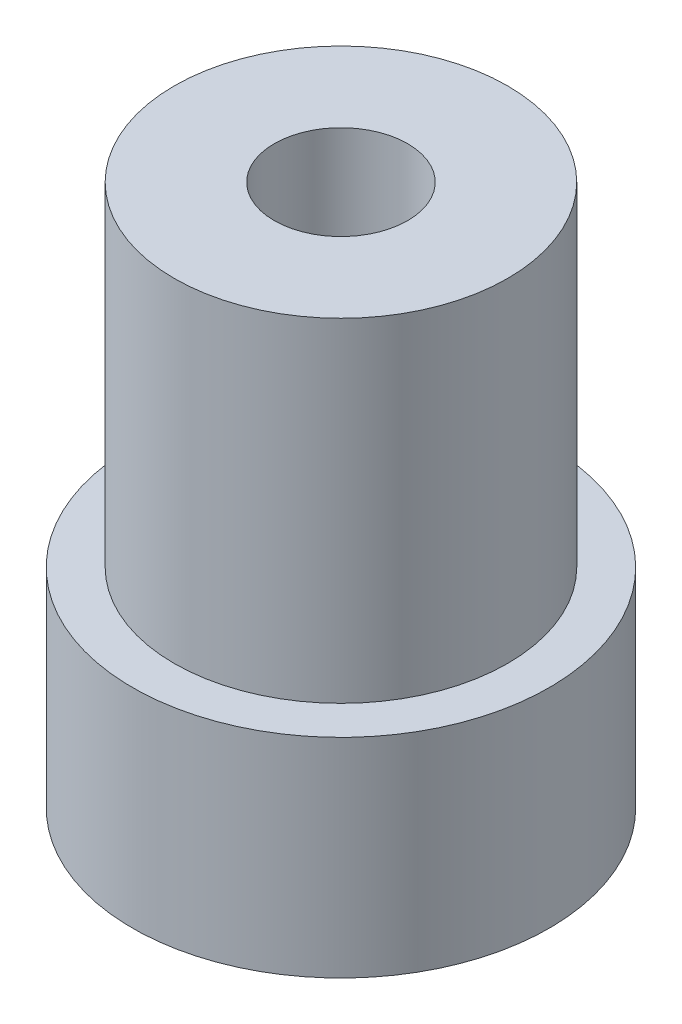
ISO-10303-21;
HEADER;
FILE_DESCRIPTION(('STEP AP214'),'2;1');
FILE_NAME('part.step','',(''),(''),'','','');
FILE_SCHEMA(('AUTOMOTIVE_DESIGN { 1 0 10303 214 1 1 1 1 }'));
ENDSEC;
DATA;
#1=APPLICATION_CONTEXT('core data for automotive mechanical design processes');
#2=APPLICATION_PROTOCOL_DEFINITION('international standard','automotive_design',2000,#1);
#3=PRODUCT_CONTEXT('',#1,'mechanical');
#4=PRODUCT('Part','Part','',(#3));
#5=PRODUCT_RELATED_PRODUCT_CATEGORY('part','',(#4));
#6=PRODUCT_DEFINITION_FORMATION('','',#4);
#7=PRODUCT_DEFINITION_CONTEXT('part definition',#1,'design');
#8=PRODUCT_DEFINITION('design','',#6,#7);
#9=PRODUCT_DEFINITION_SHAPE('','',#8);
#10=(LENGTH_UNIT() NAMED_UNIT(*) SI_UNIT(.MILLI.,.METRE.));
#11=(NAMED_UNIT(*) PLANE_ANGLE_UNIT() SI_UNIT($,.RADIAN.));
#12=(NAMED_UNIT(*) SI_UNIT($,.STERADIAN.) SOLID_ANGLE_UNIT());
#13=UNCERTAINTY_MEASURE_WITH_UNIT(LENGTH_MEASURE(1.E-05),#10,'distance_accuracy_value','');
#14=(GEOMETRIC_REPRESENTATION_CONTEXT(3) GLOBAL_UNCERTAINTY_ASSIGNED_CONTEXT((#13)) GLOBAL_UNIT_ASSIGNED_CONTEXT((#10,
#11,#12)) REPRESENTATION_CONTEXT('',''));
#15=CARTESIAN_POINT('',(0.,0.,0.));
#16=DIRECTION('',(0.,0.,1.));
#17=DIRECTION('',(1.,0.,0.));
#18=AXIS2_PLACEMENT_3D('',#15,#16,#17);
#19=CARTESIAN_POINT('',(0.,8.,0.));
#20=DIRECTION('',(0.,1.,0.));
#21=DIRECTION('',(0.,0.,1.));
#22=AXIS2_PLACEMENT_3D('',#19,#20,#21);
#23=PLANE('',#22);
#24=CARTESIAN_POINT('',(0.,8.,0.));
#25=DIRECTION('',(0.,1.,0.));
#26=DIRECTION('',(0.,0.,1.));
#27=AXIS2_PLACEMENT_3D('',#24,#25,#26);
#28=CIRCLE('',#27,4.);
#29=CARTESIAN_POINT('',(0.,8.,4.));
#30=VERTEX_POINT('',#29);
#31=EDGE_CURVE('E12',#30,#30,#28,.T.);
#32=ORIENTED_EDGE('',*,*,#31,.T.);
#33=EDGE_LOOP('',(#32));
#34=FACE_BOUND('',#33,.T.);
#35=CARTESIAN_POINT('',(0.,8.,0.));
#36=DIRECTION('',(0.,1.,0.));
#37=DIRECTION('',(0.,0.,1.));
#38=AXIS2_PLACEMENT_3D('',#35,#36,#37);
#39=CIRCLE('',#38,1.6);
#40=CARTESIAN_POINT('',(0.,8.,1.6));
#41=VERTEX_POINT('',#40);
#42=EDGE_CURVE('E49',#41,#41,#39,.T.);
#43=ORIENTED_EDGE('',*,*,#42,.F.);
#44=EDGE_LOOP('',(#43));
#45=FACE_BOUND('',#44,.T.);
#46=ADVANCED_FACE('F41',(#34,#45),#23,.T.);
#47=CARTESIAN_POINT('',(0.,8.,0.));
#48=DIRECTION('',(0.,-1.,0.));
#49=DIRECTION('',(0.,0.,-1.));
#50=AXIS2_PLACEMENT_3D('',#47,#48,#49);
#51=CYLINDRICAL_SURFACE('',#50,4.);
#52=ORIENTED_EDGE('',*,*,#31,.F.);
#53=EDGE_LOOP('',(#52));
#54=FACE_BOUND('',#53,.T.);
#55=CARTESIAN_POINT('',(0.,0.,0.));
#56=DIRECTION('',(0.,-1.,0.));
#57=DIRECTION('',(0.,0.,-1.));
#58=AXIS2_PLACEMENT_3D('',#55,#56,#57);
#59=CIRCLE('',#58,4.);
#60=CARTESIAN_POINT('',(0.,0.,-4.));
#61=VERTEX_POINT('',#60);
#62=EDGE_CURVE('E140',#61,#61,#59,.T.);
#63=ORIENTED_EDGE('',*,*,#62,.F.);
#64=EDGE_LOOP('',(#63));
#65=FACE_BOUND('',#64,.T.);
#66=ADVANCED_FACE('F43',(#54,#65),#51,.T.);
#67=CARTESIAN_POINT('',(0.,8.,0.));
#68=DIRECTION('',(0.,-1.,0.));
#69=DIRECTION('',(0.,0.,-1.));
#70=AXIS2_PLACEMENT_3D('',#67,#68,#69);
#71=CYLINDRICAL_SURFACE('',#70,1.6);
#72=ORIENTED_EDGE('',*,*,#42,.T.);
#73=EDGE_LOOP('',(#72));
#74=FACE_BOUND('',#73,.T.);
#75=CARTESIAN_POINT('',(0.,-2.,0.));
#76=DIRECTION('',(0.,-1.,0.));
#77=DIRECTION('',(0.,0.,-1.));
#78=AXIS2_PLACEMENT_3D('',#75,#76,#77);
#79=CIRCLE('',#78,1.6);
#80=CARTESIAN_POINT('',(0.,-2.,-1.6));
#81=VERTEX_POINT('',#80);
#82=EDGE_CURVE('E145',#81,#81,#79,.T.);
#83=ORIENTED_EDGE('',*,*,#82,.T.);
#84=EDGE_LOOP('',(#83));
#85=FACE_BOUND('',#84,.T.);
#86=ADVANCED_FACE('F163',(#74,#85),#71,.F.);
#87=CARTESIAN_POINT('',(0.,-2.,0.));
#88=DIRECTION('',(0.,-1.,0.));
#89=DIRECTION('',(0.,0.,-1.));
#90=AXIS2_PLACEMENT_3D('',#87,#88,#89);
#91=PLANE('',#90);
#92=DIRECTION('',(0.499999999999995,0.,0.866025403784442));
#93=VECTOR('',#92,1.);
#94=CARTESIAN_POINT('',(1.65988202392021,-2.,-2.87499999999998));
#95=LINE('',#94,#93);
#96=CARTESIAN_POINT('',(1.65988202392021,-2.,-2.87499999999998));
#97=VERTEX_POINT('',#96);
#98=CARTESIAN_POINT('',(3.31976404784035,-2.,0.));
#99=VERTEX_POINT('',#98);
#100=EDGE_CURVE('E148',#97,#99,#95,.T.);
#101=ORIENTED_EDGE('',*,*,#100,.T.);
#102=DIRECTION('',(-0.500000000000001,0.,0.866025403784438));
#103=VECTOR('',#102,1.);
#104=CARTESIAN_POINT('',(3.31976404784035,-2.,0.));
#105=LINE('',#104,#103);
#106=CARTESIAN_POINT('',(1.65988202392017,-2.,2.875));
#107=VERTEX_POINT('',#106);
#108=EDGE_CURVE('E109',#99,#107,#105,.T.);
#109=ORIENTED_EDGE('',*,*,#108,.T.);
#110=DIRECTION('',(-1.,0.,0.));
#111=VECTOR('',#110,1.);
#112=CARTESIAN_POINT('',(1.65988202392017,-2.,2.875));
#113=LINE('',#112,#111);
#114=CARTESIAN_POINT('',(-1.65988202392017,-2.,2.875));
#115=VERTEX_POINT('',#114);
#116=EDGE_CURVE('E64',#107,#115,#113,.T.);
#117=ORIENTED_EDGE('',*,*,#116,.T.);
#118=DIRECTION('',(-0.499999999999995,0.,-0.866025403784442));
#119=VECTOR('',#118,1.);
#120=CARTESIAN_POINT('',(-1.65988202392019,-2.,2.87499999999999));
#121=LINE('',#120,#119);
#122=CARTESIAN_POINT('',(-3.31976404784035,-2.,0.));
#123=VERTEX_POINT('',#122);
#124=EDGE_CURVE('E152',#115,#123,#121,.T.);
#125=ORIENTED_EDGE('',*,*,#124,.T.);
#126=DIRECTION('',(0.500000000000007,0.,-0.866025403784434));
#127=VECTOR('',#126,1.);
#128=CARTESIAN_POINT('',(-3.31976404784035,-2.,0.));
#129=LINE('',#128,#127);
#130=CARTESIAN_POINT('',(-1.65988202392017,-2.,-2.875));
#131=VERTEX_POINT('',#130);
#132=EDGE_CURVE('E155',#123,#131,#129,.T.);
#133=ORIENTED_EDGE('',*,*,#132,.T.);
#134=DIRECTION('',(1.,0.,0.));
#135=VECTOR('',#134,1.);
#136=CARTESIAN_POINT('',(-1.65988202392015,-2.,-2.87500000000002));
#137=LINE('',#136,#135);
#138=EDGE_CURVE('E158',#131,#97,#137,.T.);
#139=ORIENTED_EDGE('',*,*,#138,.T.);
#140=EDGE_LOOP('',(#101,#109,#117,#125,#133,#139));
#141=FACE_BOUND('',#140,.T.);
#142=ORIENTED_EDGE('',*,*,#82,.F.);
#143=EDGE_LOOP('',(#142));
#144=FACE_BOUND('',#143,.T.);
#145=ADVANCED_FACE('F175',(#141,#144),#91,.T.);
#146=CARTESIAN_POINT('',(0.,0.,0.));
#147=DIRECTION('',(0.,-1.,0.));
#148=DIRECTION('',(0.,0.,-1.));
#149=AXIS2_PLACEMENT_3D('',#146,#147,#148);
#150=PLANE('',#149);
#151=CARTESIAN_POINT('',(0.,0.,0.));
#152=DIRECTION('',(0.,-1.,0.));
#153=DIRECTION('',(0.,0.,-1.));
#154=AXIS2_PLACEMENT_3D('',#151,#152,#153);
#155=CIRCLE('',#154,5.);
#156=CARTESIAN_POINT('',(0.,0.,-5.));
#157=VERTEX_POINT('',#156);
#158=EDGE_CURVE('E110',#157,#157,#155,.T.);
#159=ORIENTED_EDGE('',*,*,#158,.F.);
#160=EDGE_LOOP('',(#159));
#161=FACE_BOUND('',#160,.T.);
#162=ORIENTED_EDGE('',*,*,#62,.T.);
#163=EDGE_LOOP('',(#162));
#164=FACE_BOUND('',#163,.T.);
#165=ADVANCED_FACE('F178',(#161,#164),#150,.F.);
#166=CARTESIAN_POINT('',(0.,-5.,0.));
#167=DIRECTION('',(0.,-1.,0.));
#168=DIRECTION('',(0.,0.,-1.));
#169=AXIS2_PLACEMENT_3D('',#166,#167,#168);
#170=PLANE('',#169);
#171=CARTESIAN_POINT('',(0.,-5.,0.));
#172=DIRECTION('',(0.,-1.,0.));
#173=DIRECTION('',(0.,0.,-1.));
#174=AXIS2_PLACEMENT_3D('',#171,#172,#173);
#175=CIRCLE('',#174,5.);
#176=CARTESIAN_POINT('',(0.,-5.,-5.));
#177=VERTEX_POINT('',#176);
#178=EDGE_CURVE('E137',#177,#177,#175,.T.);
#179=ORIENTED_EDGE('',*,*,#178,.T.);
#180=EDGE_LOOP('',(#179));
#181=FACE_BOUND('',#180,.T.);
#182=DIRECTION('',(-0.5,0.,0.866025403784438));
#183=VECTOR('',#182,1.);
#184=CARTESIAN_POINT('',(3.31976404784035,-5.,0.));
#185=LINE('',#184,#183);
#186=CARTESIAN_POINT('',(3.31976404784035,-5.,0.));
#187=VERTEX_POINT('',#186);
#188=CARTESIAN_POINT('',(1.65988202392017,-5.,2.875));
#189=VERTEX_POINT('',#188);
#190=EDGE_CURVE('E104',#187,#189,#185,.T.);
#191=ORIENTED_EDGE('',*,*,#190,.F.);
#192=DIRECTION('',(0.5,0.,0.866025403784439));
#193=VECTOR('',#192,1.);
#194=CARTESIAN_POINT('',(1.65988202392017,-5.,-2.875));
#195=LINE('',#194,#193);
#196=CARTESIAN_POINT('',(1.65988202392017,-5.,-2.875));
#197=VERTEX_POINT('',#196);
#198=EDGE_CURVE('E96',#197,#187,#195,.T.);
#199=ORIENTED_EDGE('',*,*,#198,.F.);
#200=DIRECTION('',(1.,0.,0.));
#201=VECTOR('',#200,1.);
#202=CARTESIAN_POINT('',(-1.65988202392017,-5.,-2.875));
#203=LINE('',#202,#201);
#204=CARTESIAN_POINT('',(-1.65988202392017,-5.,-2.875));
#205=VERTEX_POINT('',#204);
#206=EDGE_CURVE('E125',#205,#197,#203,.T.);
#207=ORIENTED_EDGE('',*,*,#206,.F.);
#208=DIRECTION('',(0.5,0.,-0.866025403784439));
#209=VECTOR('',#208,1.);
#210=CARTESIAN_POINT('',(-3.31976404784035,-5.,0.));
#211=LINE('',#210,#209);
#212=CARTESIAN_POINT('',(-3.31976404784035,-5.,0.));
#213=VERTEX_POINT('',#212);
#214=EDGE_CURVE('E122',#213,#205,#211,.T.);
#215=ORIENTED_EDGE('',*,*,#214,.F.);
#216=DIRECTION('',(-0.5,0.,-0.866025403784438));
#217=VECTOR('',#216,1.);
#218=CARTESIAN_POINT('',(-1.65988202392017,-5.,2.875));
#219=LINE('',#218,#217);
#220=CARTESIAN_POINT('',(-1.65988202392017,-5.,2.875));
#221=VERTEX_POINT('',#220);
#222=EDGE_CURVE('E118',#221,#213,#219,.T.);
#223=ORIENTED_EDGE('',*,*,#222,.F.);
#224=DIRECTION('',(-1.,0.,0.));
#225=VECTOR('',#224,1.);
#226=CARTESIAN_POINT('',(1.65988202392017,-5.,2.875));
#227=LINE('',#226,#225);
#228=EDGE_CURVE('E116',#189,#221,#227,.T.);
#229=ORIENTED_EDGE('',*,*,#228,.F.);
#230=EDGE_LOOP('',(#191,#199,#207,#215,#223,#229));
#231=FACE_BOUND('',#230,.T.);
#232=ADVANCED_FACE('F114',(#181,#231),#170,.T.);
#233=CARTESIAN_POINT('',(0.,-5.,0.));
#234=DIRECTION('',(0.,1.,0.));
#235=DIRECTION('',(0.,0.,1.));
#236=AXIS2_PLACEMENT_3D('',#233,#234,#235);
#237=CYLINDRICAL_SURFACE('',#236,5.);
#238=ORIENTED_EDGE('',*,*,#178,.F.);
#239=EDGE_LOOP('',(#238));
#240=FACE_BOUND('',#239,.T.);
#241=ORIENTED_EDGE('',*,*,#158,.T.);
#242=EDGE_LOOP('',(#241));
#243=FACE_BOUND('',#242,.T.);
#244=ADVANCED_FACE('F180',(#240,#243),#237,.T.);
#245=CARTESIAN_POINT('',(1.65988202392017,-5.,-2.875));
#246=DIRECTION('',(-0.866025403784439,0.,0.5));
#247=DIRECTION('',(0.5,0.,0.866025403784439));
#248=AXIS2_PLACEMENT_3D('',#245,#246,#247);
#249=PLANE('',#248);
#250=DIRECTION('',(0.,1.,0.));
#251=VECTOR('',#250,1.);
#252=CARTESIAN_POINT('',(3.31976404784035,-5.,0.));
#253=LINE('',#252,#251);
#254=EDGE_CURVE('E99',#187,#99,#253,.T.);
#255=ORIENTED_EDGE('',*,*,#254,.T.);
#256=ORIENTED_EDGE('',*,*,#100,.F.);
#257=DIRECTION('',(0.,1.,0.));
#258=VECTOR('',#257,1.);
#259=CARTESIAN_POINT('',(1.65988202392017,-5.,-2.875));
#260=LINE('',#259,#258);
#261=EDGE_CURVE('E56',#197,#97,#260,.T.);
#262=ORIENTED_EDGE('',*,*,#261,.F.);
#263=ORIENTED_EDGE('',*,*,#198,.T.);
#264=EDGE_LOOP('',(#255,#256,#262,#263));
#265=FACE_BOUND('',#264,.T.);
#266=ADVANCED_FACE('F98',(#265),#249,.T.);
#267=CARTESIAN_POINT('',(3.31976404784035,-5.,0.));
#268=DIRECTION('',(-0.866025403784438,0.,-0.5));
#269=DIRECTION('',(-0.5,0.,0.866025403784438));
#270=AXIS2_PLACEMENT_3D('',#267,#268,#269);
#271=PLANE('',#270);
#272=DIRECTION('',(0.,1.,0.));
#273=VECTOR('',#272,1.);
#274=CARTESIAN_POINT('',(1.65988202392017,-5.,2.875));
#275=LINE('',#274,#273);
#276=EDGE_CURVE('E111',#189,#107,#275,.T.);
#277=ORIENTED_EDGE('',*,*,#276,.T.);
#278=ORIENTED_EDGE('',*,*,#108,.F.);
#279=ORIENTED_EDGE('',*,*,#254,.F.);
#280=ORIENTED_EDGE('',*,*,#190,.T.);
#281=EDGE_LOOP('',(#277,#278,#279,#280));
#282=FACE_BOUND('',#281,.T.);
#283=ADVANCED_FACE('F107',(#282),#271,.T.);
#284=CARTESIAN_POINT('',(1.65988202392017,-5.,2.875));
#285=DIRECTION('',(0.,0.,-1.));
#286=DIRECTION('',(-1.,0.,0.));
#287=AXIS2_PLACEMENT_3D('',#284,#285,#286);
#288=PLANE('',#287);
#289=DIRECTION('',(0.,1.,0.));
#290=VECTOR('',#289,1.);
#291=CARTESIAN_POINT('',(-1.65988202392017,-5.,2.875));
#292=LINE('',#291,#290);
#293=EDGE_CURVE('E134',#221,#115,#292,.T.);
#294=ORIENTED_EDGE('',*,*,#293,.T.);
#295=ORIENTED_EDGE('',*,*,#116,.F.);
#296=ORIENTED_EDGE('',*,*,#276,.F.);
#297=ORIENTED_EDGE('',*,*,#228,.T.);
#298=EDGE_LOOP('',(#294,#295,#296,#297));
#299=FACE_BOUND('',#298,.T.);
#300=ADVANCED_FACE('F194',(#299),#288,.T.);
#301=CARTESIAN_POINT('',(-1.65988202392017,-5.,2.875));
#302=DIRECTION('',(0.866025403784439,0.,-0.5));
#303=DIRECTION('',(-0.5,0.,-0.866025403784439));
#304=AXIS2_PLACEMENT_3D('',#301,#302,#303);
#305=PLANE('',#304);
#306=DIRECTION('',(0.,1.,0.));
#307=VECTOR('',#306,1.);
#308=CARTESIAN_POINT('',(-3.31976404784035,-5.,0.));
#309=LINE('',#308,#307);
#310=EDGE_CURVE('E131',#213,#123,#309,.T.);
#311=ORIENTED_EDGE('',*,*,#310,.T.);
#312=ORIENTED_EDGE('',*,*,#124,.F.);
#313=ORIENTED_EDGE('',*,*,#293,.F.);
#314=ORIENTED_EDGE('',*,*,#222,.T.);
#315=EDGE_LOOP('',(#311,#312,#313,#314));
#316=FACE_BOUND('',#315,.T.);
#317=ADVANCED_FACE('F197',(#316),#305,.T.);
#318=CARTESIAN_POINT('',(-3.31976404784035,-5.,0.));
#319=DIRECTION('',(0.866025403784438,0.,0.5));
#320=DIRECTION('',(0.5,0.,-0.866025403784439));
#321=AXIS2_PLACEMENT_3D('',#318,#319,#320);
#322=PLANE('',#321);
#323=DIRECTION('',(0.,1.,0.));
#324=VECTOR('',#323,1.);
#325=CARTESIAN_POINT('',(-1.65988202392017,-5.,-2.875));
#326=LINE('',#325,#324);
#327=EDGE_CURVE('E128',#205,#131,#326,.T.);
#328=ORIENTED_EDGE('',*,*,#327,.T.);
#329=ORIENTED_EDGE('',*,*,#132,.F.);
#330=ORIENTED_EDGE('',*,*,#310,.F.);
#331=ORIENTED_EDGE('',*,*,#214,.T.);
#332=EDGE_LOOP('',(#328,#329,#330,#331));
#333=FACE_BOUND('',#332,.T.);
#334=ADVANCED_FACE('F200',(#333),#322,.T.);
#335=CARTESIAN_POINT('',(-1.65988202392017,-5.,-2.875));
#336=DIRECTION('',(0.,0.,1.));
#337=DIRECTION('',(1.,0.,0.));
#338=AXIS2_PLACEMENT_3D('',#335,#336,#337);
#339=PLANE('',#338);
#340=ORIENTED_EDGE('',*,*,#261,.T.);
#341=ORIENTED_EDGE('',*,*,#138,.F.);
#342=ORIENTED_EDGE('',*,*,#327,.F.);
#343=ORIENTED_EDGE('',*,*,#206,.T.);
#344=EDGE_LOOP('',(#340,#341,#342,#343));
#345=FACE_BOUND('',#344,.T.);
#346=ADVANCED_FACE('F204',(#345),#339,.T.);
#347=CLOSED_SHELL('',(#46,#66,#86,#145,#165,#232,#244,#266,#283,#300,#317,#334,#346));
#348=MANIFOLD_SOLID_BREP('B2',#347);
#349=ADVANCED_BREP_SHAPE_REPRESENTATION('',(#18,#348),#14);
#350=SHAPE_DEFINITION_REPRESENTATION(#9,#349);
ENDSEC;
END-ISO-10303-21;
